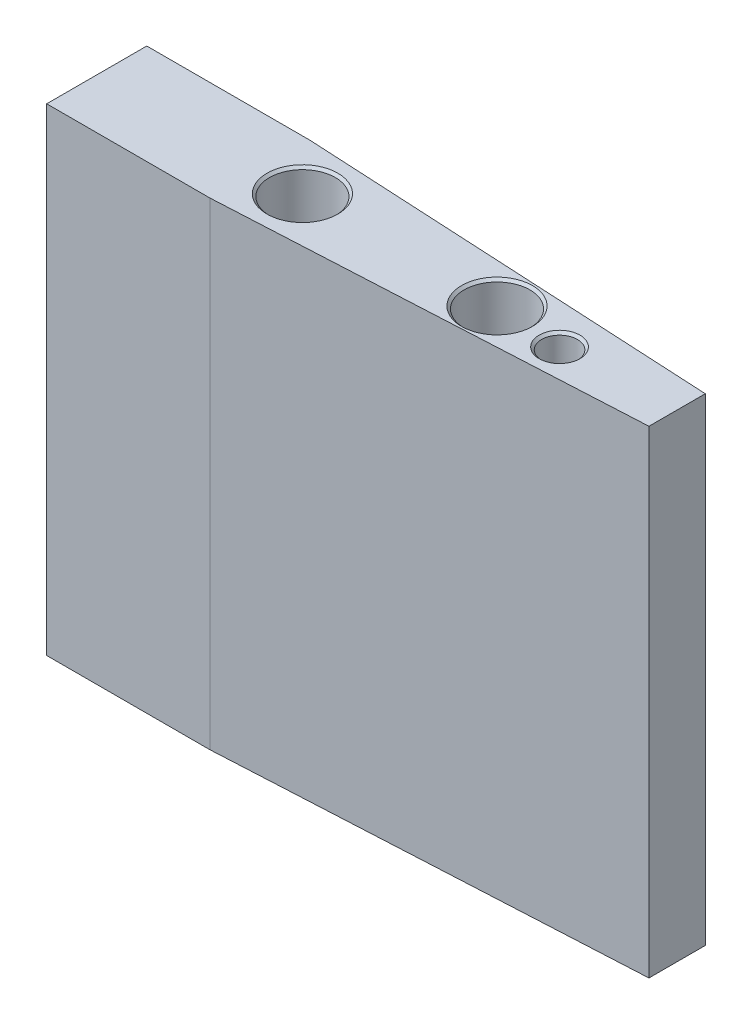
ISO-10303-21;
HEADER;
FILE_DESCRIPTION(('STEP AP214'),'2;1');
FILE_NAME('part.step','',(''),(''),'','','');
FILE_SCHEMA(('AUTOMOTIVE_DESIGN { 1 0 10303 214 1 1 1 1 }'));
ENDSEC;
DATA;
#1=APPLICATION_CONTEXT('core data for automotive mechanical design processes');
#2=APPLICATION_PROTOCOL_DEFINITION('international standard','automotive_design',2000,#1);
#3=PRODUCT_CONTEXT('',#1,'mechanical');
#4=PRODUCT('Part','Part','',(#3));
#5=PRODUCT_RELATED_PRODUCT_CATEGORY('part','',(#4));
#6=PRODUCT_DEFINITION_FORMATION('','',#4);
#7=PRODUCT_DEFINITION_CONTEXT('part definition',#1,'design');
#8=PRODUCT_DEFINITION('design','',#6,#7);
#9=PRODUCT_DEFINITION_SHAPE('','',#8);
#10=(LENGTH_UNIT() NAMED_UNIT(*) SI_UNIT(.MILLI.,.METRE.));
#11=(NAMED_UNIT(*) PLANE_ANGLE_UNIT() SI_UNIT($,.RADIAN.));
#12=(NAMED_UNIT(*) SI_UNIT($,.STERADIAN.) SOLID_ANGLE_UNIT());
#13=UNCERTAINTY_MEASURE_WITH_UNIT(LENGTH_MEASURE(1.E-05),#10,'distance_accuracy_value','');
#14=(GEOMETRIC_REPRESENTATION_CONTEXT(3) GLOBAL_UNCERTAINTY_ASSIGNED_CONTEXT((#13)) GLOBAL_UNIT_ASSIGNED_CONTEXT((#10,
#11,#12)) REPRESENTATION_CONTEXT('',''));
#15=CARTESIAN_POINT('',(0.,0.,0.));
#16=DIRECTION('',(0.,0.,1.));
#17=DIRECTION('',(1.,0.,0.));
#18=AXIS2_PLACEMENT_3D('',#15,#16,#17);
#19=CARTESIAN_POINT('',(19.5809830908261,68.2269070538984,-6.));
#20=DIRECTION('',(-0.0523359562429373,0.,0.998629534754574));
#21=DIRECTION('',(0.998629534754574,0.,0.0523359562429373));
#22=AXIS2_PLACEMENT_3D('',#19,#20,#21);
#23=PLANE('',#22);
#24=DIRECTION('',(-0.998629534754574,0.,-0.0523359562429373));
#25=VECTOR('',#24,1.);
#26=CARTESIAN_POINT('',(19.5809830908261,-2.4,-6.));
#27=LINE('',#26,#25);
#28=CARTESIAN_POINT('',(69.6,-2.4,-3.37861440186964));
#29=VERTEX_POINT('',#28);
#30=CARTESIAN_POINT('',(19.5809830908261,-2.4,-6.));
#31=VERTEX_POINT('',#30);
#32=EDGE_CURVE('E117',#29,#31,#27,.T.);
#33=ORIENTED_EDGE('',*,*,#32,.F.);
#34=DIRECTION('',(0.,-1.,0.));
#35=VECTOR('',#34,1.);
#36=CARTESIAN_POINT('',(69.6,68.2269070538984,-3.37861440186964));
#37=LINE('',#36,#35);
#38=CARTESIAN_POINT('',(69.6,-59.7,-3.37861440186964));
#39=VERTEX_POINT('',#38);
#40=EDGE_CURVE('E52',#29,#39,#37,.T.);
#41=ORIENTED_EDGE('',*,*,#40,.T.);
#42=DIRECTION('',(-0.998629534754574,0.,-0.0523359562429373));
#43=VECTOR('',#42,1.);
#44=CARTESIAN_POINT('',(19.5809830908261,-59.7,-6.));
#45=LINE('',#44,#43);
#46=CARTESIAN_POINT('',(19.5809830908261,-59.7,-6.));
#47=VERTEX_POINT('',#46);
#48=EDGE_CURVE('E125',#39,#47,#45,.T.);
#49=ORIENTED_EDGE('',*,*,#48,.T.);
#50=DIRECTION('',(0.,-1.,0.));
#51=VECTOR('',#50,1.);
#52=CARTESIAN_POINT('',(19.5809830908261,68.2269070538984,-6.));
#53=LINE('',#52,#51);
#54=EDGE_CURVE('E83',#31,#47,#53,.T.);
#55=ORIENTED_EDGE('',*,*,#54,.F.);
#56=EDGE_LOOP('',(#33,#41,#49,#55));
#57=FACE_BOUND('',#56,.T.);
#58=ADVANCED_FACE('F35',(#57),#23,.F.);
#59=CARTESIAN_POINT('',(0.,68.2269070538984,-6.00000000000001));
#60=DIRECTION('',(0.,0.,1.));
#61=DIRECTION('',(1.,0.,0.));
#62=AXIS2_PLACEMENT_3D('',#59,#60,#61);
#63=PLANE('',#62);
#64=DIRECTION('',(-1.,0.,0.));
#65=VECTOR('',#64,1.);
#66=CARTESIAN_POINT('',(0.,-2.4,-6.00000000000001));
#67=LINE('',#66,#65);
#68=CARTESIAN_POINT('',(0.,-2.4,-6.00000000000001));
#69=VERTEX_POINT('',#68);
#70=EDGE_CURVE('E90',#31,#69,#67,.T.);
#71=ORIENTED_EDGE('',*,*,#70,.F.);
#72=ORIENTED_EDGE('',*,*,#54,.T.);
#73=DIRECTION('',(-1.,0.,0.));
#74=VECTOR('',#73,1.);
#75=CARTESIAN_POINT('',(0.,-59.7,-6.00000000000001));
#76=LINE('',#75,#74);
#77=CARTESIAN_POINT('',(0.,-59.7,-6.00000000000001));
#78=VERTEX_POINT('',#77);
#79=EDGE_CURVE('E124',#47,#78,#76,.T.);
#80=ORIENTED_EDGE('',*,*,#79,.T.);
#81=DIRECTION('',(0.,-1.,0.));
#82=VECTOR('',#81,1.);
#83=CARTESIAN_POINT('',(0.,68.2269070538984,-6.00000000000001));
#84=LINE('',#83,#82);
#85=EDGE_CURVE('E126',#69,#78,#84,.T.);
#86=ORIENTED_EDGE('',*,*,#85,.F.);
#87=EDGE_LOOP('',(#71,#72,#80,#86));
#88=FACE_BOUND('',#87,.T.);
#89=ADVANCED_FACE('F150',(#88),#63,.F.);
#90=CARTESIAN_POINT('',(0.,68.2269070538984,-6.00000000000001));
#91=DIRECTION('',(1.,0.,0.));
#92=DIRECTION('',(0.,0.,-1.));
#93=AXIS2_PLACEMENT_3D('',#90,#91,#92);
#94=PLANE('',#93);
#95=DIRECTION('',(0.,0.,1.));
#96=VECTOR('',#95,1.);
#97=CARTESIAN_POINT('',(0.,-2.4,-6.00000000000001));
#98=LINE('',#97,#96);
#99=CARTESIAN_POINT('',(0.,-2.4,5.99999999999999));
#100=VERTEX_POINT('',#99);
#101=EDGE_CURVE('E111',#69,#100,#98,.T.);
#102=ORIENTED_EDGE('',*,*,#101,.F.);
#103=ORIENTED_EDGE('',*,*,#85,.T.);
#104=DIRECTION('',(0.,0.,1.));
#105=VECTOR('',#104,1.);
#106=CARTESIAN_POINT('',(0.,-59.7,-6.00000000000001));
#107=LINE('',#106,#105);
#108=CARTESIAN_POINT('',(0.,-59.7,5.99999999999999));
#109=VERTEX_POINT('',#108);
#110=EDGE_CURVE('E128',#78,#109,#107,.T.);
#111=ORIENTED_EDGE('',*,*,#110,.T.);
#112=DIRECTION('',(0.,-1.,0.));
#113=VECTOR('',#112,1.);
#114=CARTESIAN_POINT('',(0.,68.2269070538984,5.99999999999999));
#115=LINE('',#114,#113);
#116=EDGE_CURVE('E129',#100,#109,#115,.T.);
#117=ORIENTED_EDGE('',*,*,#116,.F.);
#118=EDGE_LOOP('',(#102,#103,#111,#117));
#119=FACE_BOUND('',#118,.T.);
#120=ADVANCED_FACE('F155',(#119),#94,.F.);
#121=CARTESIAN_POINT('',(19.5809830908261,68.2269070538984,5.99999999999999));
#122=DIRECTION('',(0.,0.,-1.));
#123=DIRECTION('',(-1.,0.,0.));
#124=AXIS2_PLACEMENT_3D('',#121,#122,#123);
#125=PLANE('',#124);
#126=DIRECTION('',(1.,0.,0.));
#127=VECTOR('',#126,1.);
#128=CARTESIAN_POINT('',(19.5809830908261,-2.4,5.99999999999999));
#129=LINE('',#128,#127);
#130=CARTESIAN_POINT('',(19.5809830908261,-2.4,5.99999999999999));
#131=VERTEX_POINT('',#130);
#132=EDGE_CURVE('E44',#100,#131,#129,.T.);
#133=ORIENTED_EDGE('',*,*,#132,.F.);
#134=ORIENTED_EDGE('',*,*,#116,.T.);
#135=DIRECTION('',(1.,0.,0.));
#136=VECTOR('',#135,1.);
#137=CARTESIAN_POINT('',(19.5809830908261,-59.7,5.99999999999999));
#138=LINE('',#137,#136);
#139=CARTESIAN_POINT('',(19.5809830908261,-59.7,5.99999999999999));
#140=VERTEX_POINT('',#139);
#141=EDGE_CURVE('E106',#109,#140,#138,.T.);
#142=ORIENTED_EDGE('',*,*,#141,.T.);
#143=DIRECTION('',(0.,-1.,0.));
#144=VECTOR('',#143,1.);
#145=CARTESIAN_POINT('',(19.5809830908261,68.2269070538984,5.99999999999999));
#146=LINE('',#145,#144);
#147=EDGE_CURVE('E97',#131,#140,#146,.T.);
#148=ORIENTED_EDGE('',*,*,#147,.F.);
#149=EDGE_LOOP('',(#133,#134,#142,#148));
#150=FACE_BOUND('',#149,.T.);
#151=ADVANCED_FACE('F103',(#150),#125,.F.);
#152=CARTESIAN_POINT('',(69.6,68.2269070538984,3.37861440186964));
#153=DIRECTION('',(-0.0523359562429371,0.,-0.998629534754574));
#154=DIRECTION('',(-0.998629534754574,0.,0.0523359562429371));
#155=AXIS2_PLACEMENT_3D('',#152,#153,#154);
#156=PLANE('',#155);
#157=DIRECTION('',(0.998629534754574,0.,-0.0523359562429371));
#158=VECTOR('',#157,1.);
#159=CARTESIAN_POINT('',(69.6,-2.4,3.37861440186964));
#160=LINE('',#159,#158);
#161=CARTESIAN_POINT('',(69.6,-2.4,3.37861440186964));
#162=VERTEX_POINT('',#161);
#163=EDGE_CURVE('E11',#131,#162,#160,.T.);
#164=ORIENTED_EDGE('',*,*,#163,.F.);
#165=ORIENTED_EDGE('',*,*,#147,.T.);
#166=DIRECTION('',(0.998629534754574,0.,-0.0523359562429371));
#167=VECTOR('',#166,1.);
#168=CARTESIAN_POINT('',(69.6,-59.7,3.37861440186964));
#169=LINE('',#168,#167);
#170=CARTESIAN_POINT('',(69.6,-59.7,3.37861440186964));
#171=VERTEX_POINT('',#170);
#172=EDGE_CURVE('E108',#140,#171,#169,.T.);
#173=ORIENTED_EDGE('',*,*,#172,.T.);
#174=DIRECTION('',(0.,-1.,0.));
#175=VECTOR('',#174,1.);
#176=CARTESIAN_POINT('',(69.6,68.2269070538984,3.37861440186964));
#177=LINE('',#176,#175);
#178=EDGE_CURVE('E58',#162,#171,#177,.T.);
#179=ORIENTED_EDGE('',*,*,#178,.F.);
#180=EDGE_LOOP('',(#164,#165,#173,#179));
#181=FACE_BOUND('',#180,.T.);
#182=ADVANCED_FACE('F96',(#181),#156,.F.);
#183=CARTESIAN_POINT('',(69.6,68.2269070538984,-3.37861440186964));
#184=DIRECTION('',(-1.,0.,0.));
#185=DIRECTION('',(0.,0.,1.));
#186=AXIS2_PLACEMENT_3D('',#183,#184,#185);
#187=PLANE('',#186);
#188=DIRECTION('',(0.,0.,-1.));
#189=VECTOR('',#188,1.);
#190=CARTESIAN_POINT('',(69.6,-2.4,-3.37861440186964));
#191=LINE('',#190,#189);
#192=EDGE_CURVE('E120',#162,#29,#191,.T.);
#193=ORIENTED_EDGE('',*,*,#192,.F.);
#194=ORIENTED_EDGE('',*,*,#178,.T.);
#195=DIRECTION('',(0.,0.,-1.));
#196=VECTOR('',#195,1.);
#197=CARTESIAN_POINT('',(69.6,-59.7,-3.37861440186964));
#198=LINE('',#197,#196);
#199=EDGE_CURVE('E122',#171,#39,#198,.T.);
#200=ORIENTED_EDGE('',*,*,#199,.T.);
#201=ORIENTED_EDGE('',*,*,#40,.F.);
#202=EDGE_LOOP('',(#193,#194,#200,#201));
#203=FACE_BOUND('',#202,.T.);
#204=ADVANCED_FACE('F167',(#203),#187,.F.);
#205=CARTESIAN_POINT('',(0.,-59.7,0.));
#206=DIRECTION('',(0.,-1.,0.));
#207=DIRECTION('',(0.,0.,-1.));
#208=AXIS2_PLACEMENT_3D('',#205,#206,#207);
#209=PLANE('',#208);
#210=CARTESIAN_POINT('',(48.,-59.7000000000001,0.));
#211=DIRECTION('',(0.,-1.,0.));
#212=DIRECTION('',(1.,0.,0.));
#213=AXIS2_PLACEMENT_3D('',#210,#211,#212);
#214=CIRCLE('',#213,1.3);
#215=CARTESIAN_POINT('',(49.3,-59.7000000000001,0.));
#216=VERTEX_POINT('',#215);
#217=EDGE_CURVE('E226',#216,#216,#214,.T.);
#218=ORIENTED_EDGE('',*,*,#217,.F.);
#219=EDGE_LOOP('',(#218));
#220=FACE_BOUND('',#219,.T.);
#221=CARTESIAN_POINT('',(56.0000000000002,-59.7,0.5));
#222=DIRECTION('',(0.,-1.,0.));
#223=DIRECTION('',(1.,0.,0.));
#224=AXIS2_PLACEMENT_3D('',#221,#222,#223);
#225=CIRCLE('',#224,2.1499999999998);
#226=CARTESIAN_POINT('',(58.15,-59.7,0.5));
#227=VERTEX_POINT('',#226);
#228=EDGE_CURVE('E229',#227,#227,#225,.T.);
#229=ORIENTED_EDGE('',*,*,#228,.F.);
#230=EDGE_LOOP('',(#229));
#231=FACE_BOUND('',#230,.T.);
#232=CARTESIAN_POINT('',(24.6666666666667,-59.7,0.));
#233=DIRECTION('',(0.,-1.,0.));
#234=DIRECTION('',(0.,0.,-1.));
#235=AXIS2_PLACEMENT_3D('',#232,#233,#234);
#236=CIRCLE('',#235,0.5);
#237=CARTESIAN_POINT('',(24.6666666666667,-59.7,-0.5));
#238=VERTEX_POINT('',#237);
#239=EDGE_CURVE('E240',#238,#238,#236,.T.);
#240=ORIENTED_EDGE('',*,*,#239,.F.);
#241=EDGE_LOOP('',(#240));
#242=FACE_BOUND('',#241,.T.);
#243=ORIENTED_EDGE('',*,*,#48,.F.);
#244=ORIENTED_EDGE('',*,*,#199,.F.);
#245=ORIENTED_EDGE('',*,*,#172,.F.);
#246=ORIENTED_EDGE('',*,*,#141,.F.);
#247=ORIENTED_EDGE('',*,*,#110,.F.);
#248=ORIENTED_EDGE('',*,*,#79,.F.);
#249=EDGE_LOOP('',(#243,#244,#245,#246,#247,#248));
#250=FACE_BOUND('',#249,.T.);
#251=ADVANCED_FACE('F153',(#220,#231,#242,#250),#209,.T.);
#252=CARTESIAN_POINT('',(0.,-2.4,0.));
#253=DIRECTION('',(0.,1.,0.));
#254=DIRECTION('',(0.,0.,1.));
#255=AXIS2_PLACEMENT_3D('',#252,#253,#254);
#256=PLANE('',#255);
#257=CARTESIAN_POINT('',(56.,-2.39999999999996,0.5));
#258=DIRECTION('',(0.,-1.,0.));
#259=DIRECTION('',(1.,0.,0.));
#260=AXIS2_PLACEMENT_3D('',#257,#258,#259);
#261=CIRCLE('',#260,2.44999999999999);
#262=CARTESIAN_POINT('',(58.45,-2.39999999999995,0.5));
#263=VERTEX_POINT('',#262);
#264=EDGE_CURVE('E237',#263,#263,#261,.T.);
#265=ORIENTED_EDGE('',*,*,#264,.T.);
#266=EDGE_LOOP('',(#265));
#267=FACE_BOUND('',#266,.T.);
#268=CARTESIAN_POINT('',(24.6666666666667,-2.39999999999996,0.));
#269=DIRECTION('',(0.,-1.,0.));
#270=DIRECTION('',(0.,0.,-1.));
#271=AXIS2_PLACEMENT_3D('',#268,#269,#270);
#272=CIRCLE('',#271,4.25);
#273=CARTESIAN_POINT('',(24.6666666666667,-2.39999999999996,-4.25));
#274=VERTEX_POINT('',#273);
#275=EDGE_CURVE('E252',#274,#274,#272,.T.);
#276=ORIENTED_EDGE('',*,*,#275,.T.);
#277=EDGE_LOOP('',(#276));
#278=FACE_BOUND('',#277,.T.);
#279=CARTESIAN_POINT('',(48.,-2.39999999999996,0.));
#280=DIRECTION('',(0.,-1.,0.));
#281=DIRECTION('',(0.,0.,-1.));
#282=AXIS2_PLACEMENT_3D('',#279,#280,#281);
#283=CIRCLE('',#282,4.25);
#284=CARTESIAN_POINT('',(48.,-2.39999999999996,-4.25));
#285=VERTEX_POINT('',#284);
#286=EDGE_CURVE('E131',#285,#285,#283,.T.);
#287=ORIENTED_EDGE('',*,*,#286,.T.);
#288=EDGE_LOOP('',(#287));
#289=FACE_BOUND('',#288,.T.);
#290=ORIENTED_EDGE('',*,*,#192,.T.);
#291=ORIENTED_EDGE('',*,*,#32,.T.);
#292=ORIENTED_EDGE('',*,*,#70,.T.);
#293=ORIENTED_EDGE('',*,*,#101,.T.);
#294=ORIENTED_EDGE('',*,*,#132,.T.);
#295=ORIENTED_EDGE('',*,*,#163,.T.);
#296=EDGE_LOOP('',(#290,#291,#292,#293,#294,#295));
#297=FACE_BOUND('',#296,.T.);
#298=ADVANCED_FACE('F37',(#267,#278,#289,#297),#256,.T.);
#299=CARTESIAN_POINT('',(48.,-2.70000000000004,0.));
#300=DIRECTION('',(0.,1.,0.));
#301=DIRECTION('',(0.,0.,1.));
#302=AXIS2_PLACEMENT_3D('',#299,#300,#301);
#303=CONICAL_SURFACE('',#302,3.95,0.785398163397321);
#304=ORIENTED_EDGE('',*,*,#286,.F.);
#305=EDGE_LOOP('',(#304));
#306=FACE_BOUND('',#305,.T.);
#307=CARTESIAN_POINT('',(48.,-2.70000000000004,0.));
#308=DIRECTION('',(0.,-1.,0.));
#309=DIRECTION('',(0.,0.,-1.));
#310=AXIS2_PLACEMENT_3D('',#307,#308,#309);
#311=CIRCLE('',#310,3.95);
#312=CARTESIAN_POINT('',(48.,-2.70000000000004,-3.95));
#313=VERTEX_POINT('',#312);
#314=EDGE_CURVE('E135',#313,#313,#311,.T.);
#315=ORIENTED_EDGE('',*,*,#314,.T.);
#316=EDGE_LOOP('',(#315));
#317=FACE_BOUND('',#316,.T.);
#318=ADVANCED_FACE('F178',(#306,#317),#303,.F.);
#319=CARTESIAN_POINT('',(48.,-992.668015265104,0.));
#320=DIRECTION('',(0.,-1.,0.));
#321=DIRECTION('',(0.,0.,-1.));
#322=AXIS2_PLACEMENT_3D('',#319,#320,#321);
#323=CYLINDRICAL_SURFACE('',#322,3.95000000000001);
#324=ORIENTED_EDGE('',*,*,#314,.F.);
#325=EDGE_LOOP('',(#324));
#326=FACE_BOUND('',#325,.T.);
#327=CARTESIAN_POINT('',(48.,-52.7081415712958,0.));
#328=DIRECTION('',(0.,-1.,0.));
#329=DIRECTION('',(0.,0.,-1.));
#330=AXIS2_PLACEMENT_3D('',#327,#328,#329);
#331=CIRCLE('',#330,3.95000000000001);
#332=CARTESIAN_POINT('',(48.,-52.7081415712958,3.95000000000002));
#333=VERTEX_POINT('',#332);
#334=EDGE_CURVE('E140',#333,#333,#331,.T.);
#335=ORIENTED_EDGE('',*,*,#334,.T.);
#336=EDGE_LOOP('',(#335));
#337=FACE_BOUND('',#336,.T.);
#338=ADVANCED_FACE('F181',(#326,#337),#323,.F.);
#339=CARTESIAN_POINT('',(48.,-54.7,0.));
#340=DIRECTION('',(0.,1.,0.));
#341=DIRECTION('',(0.,0.,1.));
#342=AXIS2_PLACEMENT_3D('',#339,#340,#341);
#343=CONICAL_SURFACE('',#342,0.5,1.0471975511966);
#344=CARTESIAN_POINT('',(48.,-54.7,0.));
#345=DIRECTION('',(0.,-1.,0.));
#346=DIRECTION('',(0.,0.,-1.));
#347=AXIS2_PLACEMENT_3D('',#344,#345,#346);
#348=CIRCLE('',#347,0.5);
#349=CARTESIAN_POINT('',(48.,-54.7,0.500000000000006));
#350=VERTEX_POINT('',#349);
#351=EDGE_CURVE('E255',#350,#350,#348,.T.);
#352=CARTESIAN_POINT('',(48.,-52.7081415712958,3.95000000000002));
#353=CARTESIAN_POINT('',(48.,-52.7288900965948,3.91406250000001));
#354=CARTESIAN_POINT('',(48.,-52.7496386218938,3.87812500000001));
#355=CARTESIAN_POINT('',(48.,-52.7911356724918,3.80625000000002));
#356=CARTESIAN_POINT('',(48.,-52.8118841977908,3.77031250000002));
#357=CARTESIAN_POINT('',(48.,-52.8533812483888,3.69843750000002));
#358=CARTESIAN_POINT('',(48.,-52.8741297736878,3.66250000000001));
#359=CARTESIAN_POINT('',(48.,-52.9156268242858,3.59062500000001));
#360=CARTESIAN_POINT('',(48.,-52.9363753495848,3.55468750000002));
#361=CARTESIAN_POINT('',(48.,-52.9778724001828,3.48281250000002));
#362=CARTESIAN_POINT('',(48.,-52.9986209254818,3.44687500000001));
#363=CARTESIAN_POINT('',(48.,-53.0401179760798,3.37500000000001));
#364=CARTESIAN_POINT('',(48.,-53.0608665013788,3.33906250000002));
#365=CARTESIAN_POINT('',(48.,-53.1023635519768,3.26718750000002));
#366=CARTESIAN_POINT('',(48.,-53.1231120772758,3.23125000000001));
#367=CARTESIAN_POINT('',(48.,-53.1646091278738,3.15937500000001));
#368=CARTESIAN_POINT('',(48.,-53.1853576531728,3.12343750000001));
#369=CARTESIAN_POINT('',(48.,-53.2268547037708,3.05156250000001));
#370=CARTESIAN_POINT('',(48.,-53.2476032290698,3.01562500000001));
#371=CARTESIAN_POINT('',(48.,-53.2891002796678,2.94375000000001));
#372=CARTESIAN_POINT('',(48.,-53.3098488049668,2.90781250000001));
#373=CARTESIAN_POINT('',(48.,-53.3513458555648,2.83593750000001));
#374=CARTESIAN_POINT('',(48.,-53.3720943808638,2.80000000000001));
#375=CARTESIAN_POINT('',(48.,-53.4135914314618,2.72812500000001));
#376=CARTESIAN_POINT('',(48.,-53.4343399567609,2.69218750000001));
#377=CARTESIAN_POINT('',(48.,-53.4758370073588,2.62031250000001));
#378=CARTESIAN_POINT('',(48.,-53.4965855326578,2.58437500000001));
#379=CARTESIAN_POINT('',(48.,-53.5380825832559,2.51250000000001));
#380=CARTESIAN_POINT('',(48.,-53.5588311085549,2.47656250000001));
#381=CARTESIAN_POINT('',(48.,-53.6003281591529,2.40468750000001));
#382=CARTESIAN_POINT('',(48.,-53.6210766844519,2.36875000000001));
#383=CARTESIAN_POINT('',(48.,-53.6625737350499,2.29687500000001));
#384=CARTESIAN_POINT('',(48.,-53.6833222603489,2.26093750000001));
#385=CARTESIAN_POINT('',(48.,-53.7248193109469,2.18906250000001));
#386=CARTESIAN_POINT('',(48.,-53.7455678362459,2.15312500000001));
#387=CARTESIAN_POINT('',(48.,-53.7870648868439,2.08125000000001));
#388=CARTESIAN_POINT('',(48.,-53.8078134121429,2.04531250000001));
#389=CARTESIAN_POINT('',(48.,-53.8493104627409,1.97343750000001));
#390=CARTESIAN_POINT('',(48.,-53.8700589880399,1.93750000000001));
#391=CARTESIAN_POINT('',(48.,-53.9115560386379,1.86562500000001));
#392=CARTESIAN_POINT('',(48.,-53.9323045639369,1.82968750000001));
#393=CARTESIAN_POINT('',(48.,-53.9738016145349,1.75781250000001));
#394=CARTESIAN_POINT('',(48.,-53.9945501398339,1.72187500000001));
#395=CARTESIAN_POINT('',(48.,-54.0360471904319,1.65000000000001));
#396=CARTESIAN_POINT('',(48.,-54.0567957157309,1.61406250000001));
#397=CARTESIAN_POINT('',(48.,-54.0982927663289,1.54218750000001));
#398=CARTESIAN_POINT('',(48.,-54.1190412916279,1.50625000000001));
#399=CARTESIAN_POINT('',(48.,-54.1605383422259,1.43437500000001));
#400=CARTESIAN_POINT('',(48.,-54.1812868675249,1.39843750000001));
#401=CARTESIAN_POINT('',(48.,-54.2227839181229,1.32656250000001));
#402=CARTESIAN_POINT('',(48.,-54.2435324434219,1.29062500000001));
#403=CARTESIAN_POINT('',(48.,-54.2850294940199,1.21875000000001));
#404=CARTESIAN_POINT('',(48.,-54.3057780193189,1.18281250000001));
#405=CARTESIAN_POINT('',(48.,-54.3472750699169,1.11093750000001));
#406=CARTESIAN_POINT('',(48.,-54.3680235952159,1.07500000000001));
#407=CARTESIAN_POINT('',(48.,-54.4095206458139,1.00312500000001));
#408=CARTESIAN_POINT('',(48.,-54.4302691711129,0.967187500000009));
#409=CARTESIAN_POINT('',(48.,-54.4717662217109,0.895312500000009));
#410=CARTESIAN_POINT('',(48.,-54.4925147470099,0.859375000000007));
#411=CARTESIAN_POINT('',(48.,-54.5340117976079,0.787500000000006));
#412=CARTESIAN_POINT('',(48.,-54.554760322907,0.751562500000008));
#413=CARTESIAN_POINT('',(48.,-54.596257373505,0.679687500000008));
#414=CARTESIAN_POINT('',(48.,-54.617005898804,0.643750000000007));
#415=CARTESIAN_POINT('',(48.,-54.658502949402,0.571875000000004));
#416=CARTESIAN_POINT('',(48.,-54.679251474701,0.535937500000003));
#417=CARTESIAN_POINT('',(48.,-54.7,0.500000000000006));
#418=B_SPLINE_CURVE_WITH_KNOTS('',3,(#352,#353,#354,#355,#356,#357,#358,#359,#360,#361,#362,
#363,#364,#365,#366,#367,#368,#369,#370,#371,#372,#373,#374,#375,#376,#377,#378,#379,#380,#381,
#382,#383,#384,#385,#386,#387,#388,#389,#390,#391,#392,#393,#394,#395,#396,#397,#398,#399,#400,
#401,#402,#403,#404,#405,#406,#407,#408,#409,#410,#411,#412,#413,#414,#415,#416,#417),
.UNSPECIFIED.,.F.,.F.,(4,2,2,2,2,2,2,2,2,2,2,2,2,2,2,2,2,2,2,2,2,2,2,2,2,2,2,2,2,2,2,2,4),(0.,
0.12449115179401,0.248982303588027,0.373473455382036,0.497964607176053,0.622455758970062,
0.746946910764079,0.871438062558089,0.995929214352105,1.12042036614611,1.24491151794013,
1.36940266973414,1.49389382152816,1.61838497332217,1.74287612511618,1.86736727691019,
1.99185842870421,2.11634958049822,2.24084073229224,2.36533188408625,2.48982303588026,
2.61431418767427,2.73880533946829,2.8632964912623,2.98778764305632,3.11227879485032,
3.23676994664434,3.36126109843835,3.48575225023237,3.61024340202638,3.73473455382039,
3.8592257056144,3.98371685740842),.UNSPECIFIED.);
#419=EDGE_CURVE('BSEAM185',#333,#350,#418,.T.);
#420=ORIENTED_EDGE('',*,*,#334,.F.);
#421=ORIENTED_EDGE('',*,*,#351,.T.);
#422=ORIENTED_EDGE('',*,*,#419,.T.);
#423=ORIENTED_EDGE('',*,*,#419,.F.);
#424=EDGE_LOOP('',(#420,#422,#421,#423));
#425=FACE_BOUND('',#424,.T.);
#426=ADVANCED_FACE('F185',(#425),#343,.F.);
#427=CARTESIAN_POINT('',(48.,-992.668015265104,0.));
#428=DIRECTION('',(0.,-1.,0.));
#429=DIRECTION('',(0.,0.,-1.));
#430=AXIS2_PLACEMENT_3D('',#427,#428,#429);
#431=CYLINDRICAL_SURFACE('',#430,0.5);
#432=CARTESIAN_POINT('',(48.,-59.2381197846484,0.));
#433=DIRECTION('',(0.,-1.,0.));
#434=DIRECTION('',(1.,0.,0.));
#435=AXIS2_PLACEMENT_3D('',#432,#433,#434);
#436=CIRCLE('',#435,0.5);
#437=CARTESIAN_POINT('',(48.5,-59.2381197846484,0.));
#438=VERTEX_POINT('',#437);
#439=EDGE_CURVE('E39',#438,#438,#436,.T.);
#440=ORIENTED_EDGE('',*,*,#439,.T.);
#441=EDGE_LOOP('',(#440));
#442=FACE_BOUND('',#441,.T.);
#443=ORIENTED_EDGE('',*,*,#351,.F.);
#444=EDGE_LOOP('',(#443));
#445=FACE_BOUND('',#444,.T.);
#446=ADVANCED_FACE('F189',(#442,#445),#431,.F.);
#447=CARTESIAN_POINT('',(24.6666666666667,-2.70000000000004,0.));
#448=DIRECTION('',(0.,1.,0.));
#449=DIRECTION('',(0.,0.,1.));
#450=AXIS2_PLACEMENT_3D('',#447,#448,#449);
#451=CONICAL_SURFACE('',#450,3.95,0.785398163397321);
#452=ORIENTED_EDGE('',*,*,#275,.F.);
#453=EDGE_LOOP('',(#452));
#454=FACE_BOUND('',#453,.T.);
#455=CARTESIAN_POINT('',(24.6666666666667,-2.70000000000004,0.));
#456=DIRECTION('',(0.,-1.,0.));
#457=DIRECTION('',(0.,0.,-1.));
#458=AXIS2_PLACEMENT_3D('',#455,#456,#457);
#459=CIRCLE('',#458,3.95);
#460=CARTESIAN_POINT('',(24.6666666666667,-2.70000000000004,-3.95));
#461=VERTEX_POINT('',#460);
#462=EDGE_CURVE('E249',#461,#461,#459,.T.);
#463=ORIENTED_EDGE('',*,*,#462,.T.);
#464=EDGE_LOOP('',(#463));
#465=FACE_BOUND('',#464,.T.);
#466=ADVANCED_FACE('F193',(#454,#465),#451,.F.);
#467=CARTESIAN_POINT('',(24.6666666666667,-992.668015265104,0.));
#468=DIRECTION('',(0.,-1.,0.));
#469=DIRECTION('',(0.,0.,-1.));
#470=AXIS2_PLACEMENT_3D('',#467,#468,#469);
#471=CYLINDRICAL_SURFACE('',#470,3.95000000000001);
#472=ORIENTED_EDGE('',*,*,#462,.F.);
#473=EDGE_LOOP('',(#472));
#474=FACE_BOUND('',#473,.T.);
#475=CARTESIAN_POINT('',(24.6666666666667,-52.7081415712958,0.));
#476=DIRECTION('',(0.,-1.,0.));
#477=DIRECTION('',(0.,0.,-1.));
#478=AXIS2_PLACEMENT_3D('',#475,#476,#477);
#479=CIRCLE('',#478,3.95000000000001);
#480=CARTESIAN_POINT('',(24.6666666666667,-52.7081415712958,3.95000000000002));
#481=VERTEX_POINT('',#480);
#482=EDGE_CURVE('E246',#481,#481,#479,.T.);
#483=ORIENTED_EDGE('',*,*,#482,.T.);
#484=EDGE_LOOP('',(#483));
#485=FACE_BOUND('',#484,.T.);
#486=ADVANCED_FACE('F197',(#474,#485),#471,.F.);
#487=CARTESIAN_POINT('',(24.6666666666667,-54.7,0.));
#488=DIRECTION('',(0.,1.,0.));
#489=DIRECTION('',(0.,0.,1.));
#490=AXIS2_PLACEMENT_3D('',#487,#488,#489);
#491=CONICAL_SURFACE('',#490,0.5,1.0471975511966);
#492=CARTESIAN_POINT('',(24.6666666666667,-54.7,0.));
#493=DIRECTION('',(0.,-1.,0.));
#494=DIRECTION('',(0.,0.,-1.));
#495=AXIS2_PLACEMENT_3D('',#492,#493,#494);
#496=CIRCLE('',#495,0.5);
#497=CARTESIAN_POINT('',(24.6666666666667,-54.7,0.500000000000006));
#498=VERTEX_POINT('',#497);
#499=EDGE_CURVE('E243',#498,#498,#496,.T.);
#500=CARTESIAN_POINT('',(24.6666666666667,-52.7081415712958,3.95000000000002));
#501=CARTESIAN_POINT('',(24.6666666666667,-52.7288900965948,3.91406250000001));
#502=CARTESIAN_POINT('',(24.6666666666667,-52.7496386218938,3.87812500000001));
#503=CARTESIAN_POINT('',(24.6666666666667,-52.7911356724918,3.80625000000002));
#504=CARTESIAN_POINT('',(24.6666666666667,-52.8118841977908,3.77031250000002));
#505=CARTESIAN_POINT('',(24.6666666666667,-52.8533812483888,3.69843750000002));
#506=CARTESIAN_POINT('',(24.6666666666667,-52.8741297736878,3.66250000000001));
#507=CARTESIAN_POINT('',(24.6666666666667,-52.9156268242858,3.59062500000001));
#508=CARTESIAN_POINT('',(24.6666666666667,-52.9363753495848,3.55468750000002));
#509=CARTESIAN_POINT('',(24.6666666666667,-52.9778724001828,3.48281250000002));
#510=CARTESIAN_POINT('',(24.6666666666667,-52.9986209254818,3.44687500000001));
#511=CARTESIAN_POINT('',(24.6666666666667,-53.0401179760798,3.37500000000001));
#512=CARTESIAN_POINT('',(24.6666666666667,-53.0608665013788,3.33906250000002));
#513=CARTESIAN_POINT('',(24.6666666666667,-53.1023635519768,3.26718750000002));
#514=CARTESIAN_POINT('',(24.6666666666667,-53.1231120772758,3.23125000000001));
#515=CARTESIAN_POINT('',(24.6666666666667,-53.1646091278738,3.15937500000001));
#516=CARTESIAN_POINT('',(24.6666666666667,-53.1853576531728,3.12343750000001));
#517=CARTESIAN_POINT('',(24.6666666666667,-53.2268547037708,3.05156250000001));
#518=CARTESIAN_POINT('',(24.6666666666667,-53.2476032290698,3.01562500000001));
#519=CARTESIAN_POINT('',(24.6666666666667,-53.2891002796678,2.94375000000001));
#520=CARTESIAN_POINT('',(24.6666666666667,-53.3098488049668,2.90781250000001));
#521=CARTESIAN_POINT('',(24.6666666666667,-53.3513458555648,2.83593750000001));
#522=CARTESIAN_POINT('',(24.6666666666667,-53.3720943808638,2.80000000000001));
#523=CARTESIAN_POINT('',(24.6666666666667,-53.4135914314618,2.72812500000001));
#524=CARTESIAN_POINT('',(24.6666666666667,-53.4343399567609,2.69218750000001));
#525=CARTESIAN_POINT('',(24.6666666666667,-53.4758370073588,2.62031250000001));
#526=CARTESIAN_POINT('',(24.6666666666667,-53.4965855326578,2.58437500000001));
#527=CARTESIAN_POINT('',(24.6666666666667,-53.5380825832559,2.51250000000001));
#528=CARTESIAN_POINT('',(24.6666666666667,-53.5588311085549,2.47656250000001));
#529=CARTESIAN_POINT('',(24.6666666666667,-53.6003281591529,2.40468750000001));
#530=CARTESIAN_POINT('',(24.6666666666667,-53.6210766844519,2.36875000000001));
#531=CARTESIAN_POINT('',(24.6666666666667,-53.6625737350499,2.29687500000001));
#532=CARTESIAN_POINT('',(24.6666666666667,-53.6833222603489,2.26093750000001));
#533=CARTESIAN_POINT('',(24.6666666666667,-53.7248193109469,2.18906250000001));
#534=CARTESIAN_POINT('',(24.6666666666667,-53.7455678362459,2.15312500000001));
#535=CARTESIAN_POINT('',(24.6666666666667,-53.7870648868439,2.08125000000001));
#536=CARTESIAN_POINT('',(24.6666666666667,-53.8078134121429,2.04531250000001));
#537=CARTESIAN_POINT('',(24.6666666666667,-53.8493104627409,1.97343750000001));
#538=CARTESIAN_POINT('',(24.6666666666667,-53.8700589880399,1.93750000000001));
#539=CARTESIAN_POINT('',(24.6666666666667,-53.9115560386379,1.86562500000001));
#540=CARTESIAN_POINT('',(24.6666666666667,-53.9323045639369,1.82968750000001));
#541=CARTESIAN_POINT('',(24.6666666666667,-53.9738016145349,1.75781250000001));
#542=CARTESIAN_POINT('',(24.6666666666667,-53.9945501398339,1.72187500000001));
#543=CARTESIAN_POINT('',(24.6666666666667,-54.0360471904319,1.65000000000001));
#544=CARTESIAN_POINT('',(24.6666666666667,-54.0567957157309,1.61406250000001));
#545=CARTESIAN_POINT('',(24.6666666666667,-54.0982927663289,1.54218750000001));
#546=CARTESIAN_POINT('',(24.6666666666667,-54.1190412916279,1.50625000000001));
#547=CARTESIAN_POINT('',(24.6666666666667,-54.1605383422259,1.43437500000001));
#548=CARTESIAN_POINT('',(24.6666666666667,-54.1812868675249,1.39843750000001));
#549=CARTESIAN_POINT('',(24.6666666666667,-54.2227839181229,1.32656250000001));
#550=CARTESIAN_POINT('',(24.6666666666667,-54.2435324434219,1.29062500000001));
#551=CARTESIAN_POINT('',(24.6666666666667,-54.2850294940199,1.21875000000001));
#552=CARTESIAN_POINT('',(24.6666666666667,-54.3057780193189,1.18281250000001));
#553=CARTESIAN_POINT('',(24.6666666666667,-54.3472750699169,1.11093750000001));
#554=CARTESIAN_POINT('',(24.6666666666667,-54.3680235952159,1.07500000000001));
#555=CARTESIAN_POINT('',(24.6666666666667,-54.4095206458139,1.00312500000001));
#556=CARTESIAN_POINT('',(24.6666666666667,-54.4302691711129,0.967187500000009));
#557=CARTESIAN_POINT('',(24.6666666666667,-54.4717662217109,0.895312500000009));
#558=CARTESIAN_POINT('',(24.6666666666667,-54.4925147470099,0.859375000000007));
#559=CARTESIAN_POINT('',(24.6666666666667,-54.5340117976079,0.787500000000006));
#560=CARTESIAN_POINT('',(24.6666666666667,-54.554760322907,0.751562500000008));
#561=CARTESIAN_POINT('',(24.6666666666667,-54.596257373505,0.679687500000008));
#562=CARTESIAN_POINT('',(24.6666666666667,-54.617005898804,0.643750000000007));
#563=CARTESIAN_POINT('',(24.6666666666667,-54.658502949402,0.571875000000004));
#564=CARTESIAN_POINT('',(24.6666666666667,-54.679251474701,0.535937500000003));
#565=CARTESIAN_POINT('',(24.6666666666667,-54.7,0.500000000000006));
#566=B_SPLINE_CURVE_WITH_KNOTS('',3,(#500,#501,#502,#503,#504,#505,#506,#507,#508,#509,#510,
#511,#512,#513,#514,#515,#516,#517,#518,#519,#520,#521,#522,#523,#524,#525,#526,#527,#528,#529,
#530,#531,#532,#533,#534,#535,#536,#537,#538,#539,#540,#541,#542,#543,#544,#545,#546,#547,#548,
#549,#550,#551,#552,#553,#554,#555,#556,#557,#558,#559,#560,#561,#562,#563,#564,#565),
.UNSPECIFIED.,.F.,.F.,(4,2,2,2,2,2,2,2,2,2,2,2,2,2,2,2,2,2,2,2,2,2,2,2,2,2,2,2,2,2,2,2,4),(0.,
0.12449115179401,0.248982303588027,0.373473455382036,0.497964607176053,0.622455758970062,
0.746946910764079,0.871438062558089,0.995929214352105,1.12042036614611,1.24491151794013,
1.36940266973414,1.49389382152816,1.61838497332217,1.74287612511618,1.86736727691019,
1.99185842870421,2.11634958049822,2.24084073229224,2.36533188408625,2.48982303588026,
2.61431418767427,2.73880533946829,2.8632964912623,2.98778764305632,3.11227879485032,
3.23676994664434,3.36126109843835,3.48575225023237,3.61024340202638,3.73473455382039,
3.8592257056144,3.98371685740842),.UNSPECIFIED.);
#567=EDGE_CURVE('BSEAM201',#481,#498,#566,.T.);
#568=ORIENTED_EDGE('',*,*,#482,.F.);
#569=ORIENTED_EDGE('',*,*,#499,.T.);
#570=ORIENTED_EDGE('',*,*,#567,.T.);
#571=ORIENTED_EDGE('',*,*,#567,.F.);
#572=EDGE_LOOP('',(#568,#570,#569,#571));
#573=FACE_BOUND('',#572,.T.);
#574=ADVANCED_FACE('F201',(#573),#491,.F.);
#575=CARTESIAN_POINT('',(24.6666666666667,-992.668015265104,0.));
#576=DIRECTION('',(0.,-1.,0.));
#577=DIRECTION('',(0.,0.,-1.));
#578=AXIS2_PLACEMENT_3D('',#575,#576,#577);
#579=CYLINDRICAL_SURFACE('',#578,0.5);
#580=ORIENTED_EDGE('',*,*,#499,.F.);
#581=EDGE_LOOP('',(#580));
#582=FACE_BOUND('',#581,.T.);
#583=ORIENTED_EDGE('',*,*,#239,.T.);
#584=EDGE_LOOP('',(#583));
#585=FACE_BOUND('',#584,.T.);
#586=ADVANCED_FACE('F205',(#582,#585),#579,.F.);
#587=CARTESIAN_POINT('',(56.,-2.70000000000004,0.5));
#588=DIRECTION('',(0.,1.,0.));
#589=DIRECTION('',(-1.,0.,0.));
#590=AXIS2_PLACEMENT_3D('',#587,#588,#589);
#591=CONICAL_SURFACE('',#590,2.14999999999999,0.785398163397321);
#592=ORIENTED_EDGE('',*,*,#264,.F.);
#593=EDGE_LOOP('',(#592));
#594=FACE_BOUND('',#593,.T.);
#595=CARTESIAN_POINT('',(56.,-2.70000000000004,0.5));
#596=DIRECTION('',(0.,-1.,0.));
#597=DIRECTION('',(1.,0.,0.));
#598=AXIS2_PLACEMENT_3D('',#595,#596,#597);
#599=CIRCLE('',#598,2.14999999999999);
#600=CARTESIAN_POINT('',(58.15,-2.70000000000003,0.5));
#601=VERTEX_POINT('',#600);
#602=EDGE_CURVE('E231',#601,#601,#599,.T.);
#603=ORIENTED_EDGE('',*,*,#602,.T.);
#604=EDGE_LOOP('',(#603));
#605=FACE_BOUND('',#604,.T.);
#606=ADVANCED_FACE('F209',(#594,#605),#591,.F.);
#607=CARTESIAN_POINT('',(56.0000000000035,-1000.,0.5));
#608=DIRECTION('',(0.,-1.,0.));
#609=DIRECTION('',(1.,0.,0.));
#610=AXIS2_PLACEMENT_3D('',#607,#608,#609);
#611=CYLINDRICAL_SURFACE('',#610,2.1499999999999);
#612=ORIENTED_EDGE('',*,*,#602,.F.);
#613=EDGE_LOOP('',(#612));
#614=FACE_BOUND('',#613,.T.);
#615=ORIENTED_EDGE('',*,*,#228,.T.);
#616=EDGE_LOOP('',(#615));
#617=FACE_BOUND('',#616,.T.);
#618=ADVANCED_FACE('F213',(#614,#617),#611,.F.);
#619=CARTESIAN_POINT('',(48.,-59.7000000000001,0.));
#620=DIRECTION('',(0.,-1.,0.));
#621=DIRECTION('',(1.,0.,0.));
#622=AXIS2_PLACEMENT_3D('',#619,#620,#621);
#623=CONICAL_SURFACE('',#622,1.3,1.0471975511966);
#624=ORIENTED_EDGE('',*,*,#217,.T.);
#625=EDGE_LOOP('',(#624));
#626=FACE_BOUND('',#625,.T.);
#627=ORIENTED_EDGE('',*,*,#439,.F.);
#628=EDGE_LOOP('',(#627));
#629=FACE_BOUND('',#628,.T.);
#630=ADVANCED_FACE('F217',(#626,#629),#623,.F.);
#631=CLOSED_SHELL('',(#58,#89,#120,#151,#182,#204,#251,#298,#318,#338,#426,#446,#466,#486,#574,
#586,#606,#618,#630));
#632=MANIFOLD_SOLID_BREP('B2',#631);
#633=ADVANCED_BREP_SHAPE_REPRESENTATION('',(#18,#632),#14);
#634=SHAPE_DEFINITION_REPRESENTATION(#9,#633);
ENDSEC;
END-ISO-10303-21;
